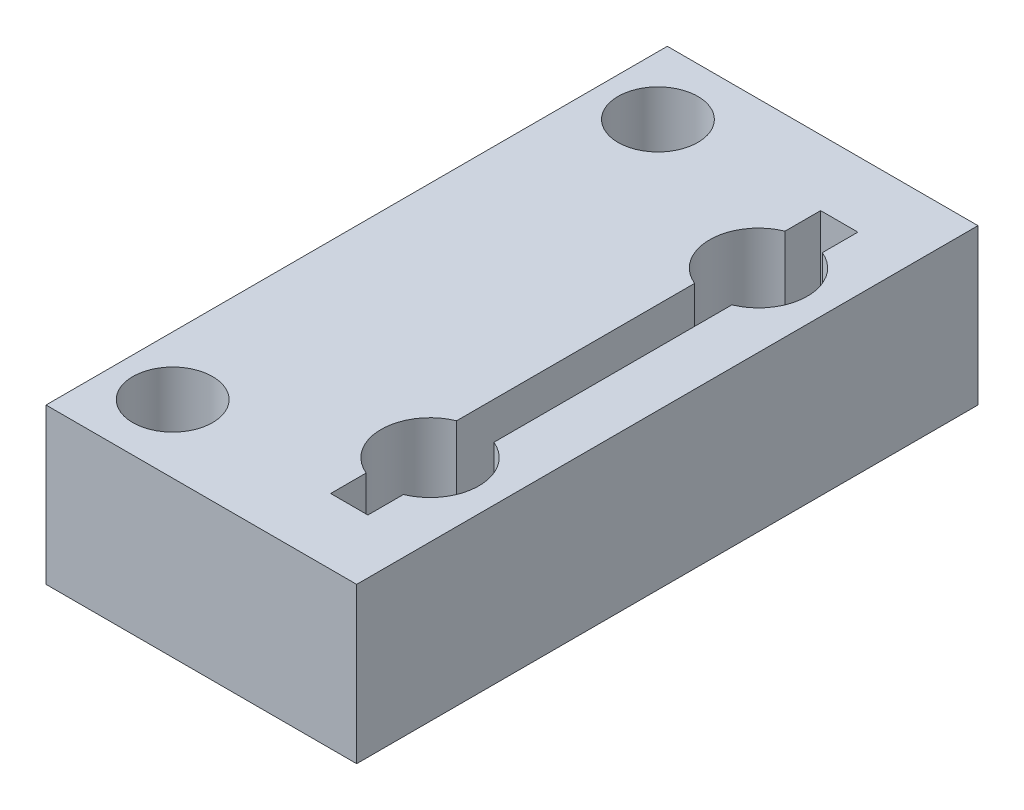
from build123d import *

# Parameters (mm, degrees)
SKETCH1_W             = 12.7
SKETCH1_H             = 25.4
EXTRUDE1_DEPTH        = 3.175
CUT_EXTRUDE1_DEPTH    = 16.554259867
F_4_CLEARANCE_HOLE1_D = 3.2639


with BuildPart() as part:
    # Sketch1 → Extrude1 (new, symmetric)
    with BuildSketch(Plane(origin=(0, 0, 0), x_dir=(1, 0, 0), z_dir=(0, 1, 0))):
        Rectangle(SKETCH1_W, SKETCH1_H)
    extrude(amount=EXTRUDE1_DEPTH, both=True)

    # Sketch3 → Cut-Extrude1 (cut, through all)
    with BuildSketch(Plane(origin=(0, 3.175, 0), x_dir=(-1, 0, 0), z_dir=(0, 1, 0))):
        with BuildLine():
            Line((-4.124895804, 10.01522), (-2.600895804, 10.01522))
            Line((-2.600895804, 10.01522), (-2.600895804, 8.562370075))
            ThreePointArc((-2.600895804, 8.562370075), (-1.362895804, 6.71322), (-2.600895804, 4.864069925))
            Line((-2.600895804, 4.864069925), (-2.600895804, -4.864069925))
            ThreePointArc((-2.600895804, -4.864069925), (-1.362895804, -6.71322), (-2.600895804, -8.562370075))
            Line((-2.600895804, -8.562370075), (-2.600895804, -10.01522))
            Line((-2.600895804, -10.01522), (-4.124895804, -10.01522))
            Line((-4.124895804, -10.01522), (-4.124895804, -8.562370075))
            ThreePointArc((-4.124895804, -8.562370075), (-5.362895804, -6.71322), (-4.124895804, -4.864069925))
            Line((-4.124895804, -4.864069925), (-4.124895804, 4.864069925))
            ThreePointArc((-4.124895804, 4.864069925), (-5.362895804, 6.71322), (-4.124895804, 8.562370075))
            Line((-4.124895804, 8.562370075), (-4.124895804, 10.01522))
        make_face()
    extrude(amount=-CUT_EXTRUDE1_DEPTH, mode=Mode.SUBTRACT)

    # 4 Clearance Hole1 (through all)
    with Locations(Plane(origin=(0, 3.175, 0), x_dir=(-1, 0, 0), z_dir=(0, 1, 0))):
        with Locations((3.952304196, 9.9187), (3.952304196, -9.9187)):
            Hole(F_4_CLEARANCE_HOLE1_D / 2)


solid = part.part
